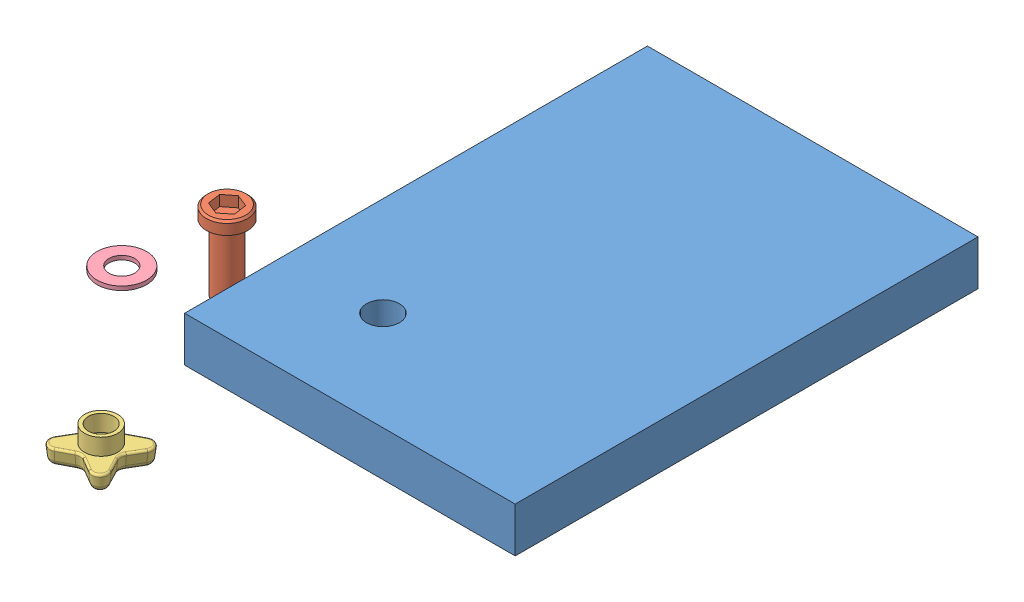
SolidWorks assembly Multiple Mate.SLDASM, configuration Default (file format 3400). Lengths in mm.
Overall size (163.9 36.51 234.29).
4 component instances, 4 part files, 0 mates.
Components (placement in the parent):
- Plate-1: Plate.SLDPRT [Default] at (6.5159 -48.8841 27.7346) size (127 17.27 177.8)
- Cap Screw-1: Cap Screw.SLDPRT [Default] at (-78.7747 -55.4881 78.5346) x (0.785894 0 -0.618361) z (0 1 0) size (15.88 15.88 30.16)
- Nut-1: Nut.SLDPRT [Default] at (-53.7499 -55.4881 151.9247) x (-0.724766 0 0.688995) z (0.688995 0 0.724766) size (29.99 12.7 29.99)
- Washer-1: Washer.SLDPRT [Default] at (-83.3025 -31.6121 114.4401) x (-0.99301 0 -0.118028) z (0 1 0) size (19.05 19.05 1.52)
